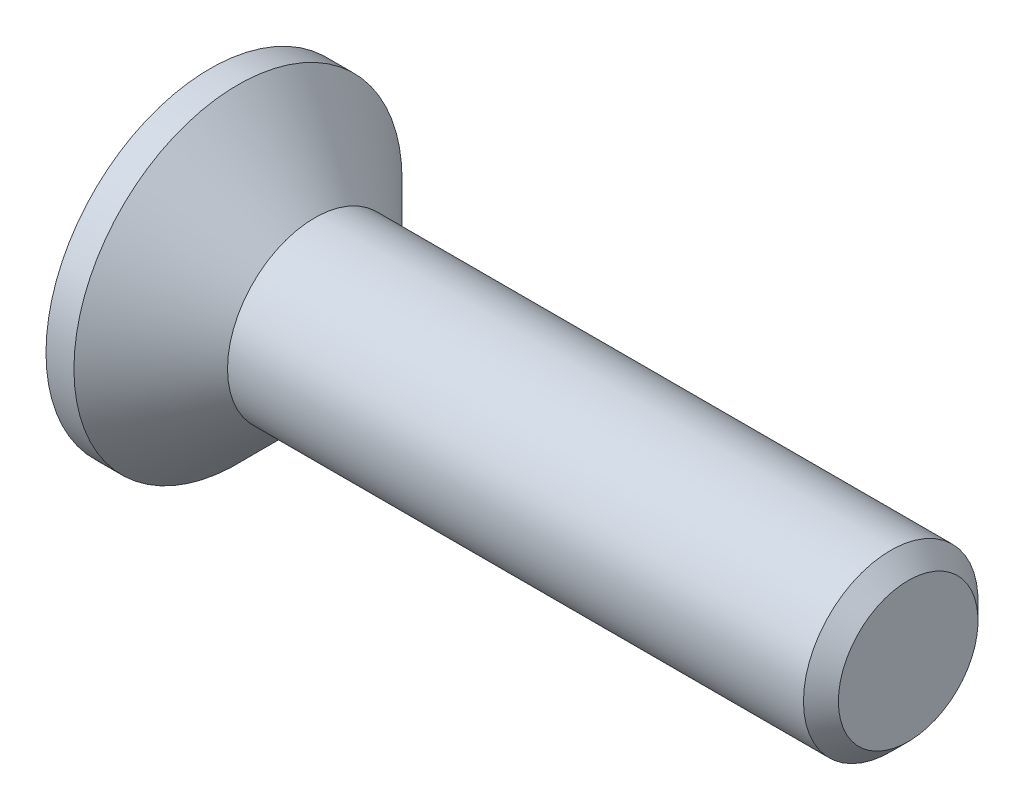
from build123d import *

# Parameters (mm, degrees)
CHAMFER1_SIZE      = 0.25
CUT_EXTRUDE1_DEPTH = 1.25


with BuildPart() as part:
    # Sketch1 → Revolve1 (revolve)
    with BuildSketch(Plane.XY, mode=Mode.PRIVATE) as revolve1_sk:
        Polygon((-1.5, 2.35), (-1.5, 0), (8.5, 0), (8.5, 1.25), (0, 1.25), (-1.1, 2.35), align=None)
    revolve(revolve1_sk.sketch.rotate(Axis((-1.5, 0, 0), (1, 0, 0)), 90), axis=Axis((-1.5, 0, 0), (1, 0, 0)))

    # Chamfer1
    chamfer1_edges = [part.edges().sort_by_distance(p)[0] for p in [
        (8.5, 0, -1.25),
    ]]
    chamfer(chamfer1_edges, length=CHAMFER1_SIZE)

    # Sketch2 → Cut-Extrude1 (cut)
    with BuildSketch(Plane.ZY.offset(1.5)):
        Polygon((-0.34, 1.35), (0.34, 1.35), (0.34, 0.34), (1.35, 0.34), (1.35, -0.34), (0.34, -0.34), (0.34, -1.35), (-0.34, -1.35), (-0.34, -0.34), (-1.35, -0.34), (-1.35, 0.34), (-0.34, 0.34), align=None)
    extrude(amount=-CUT_EXTRUDE1_DEPTH, mode=Mode.SUBTRACT)


solid = part.part
